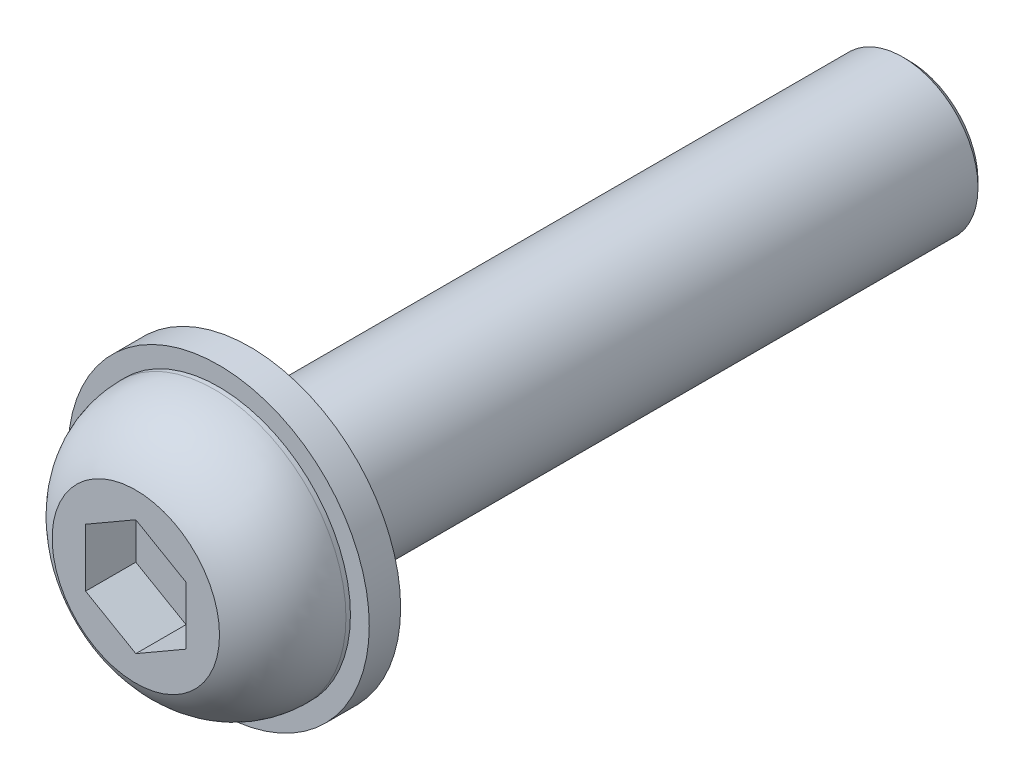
ISO-10303-21;
HEADER;
FILE_DESCRIPTION(('STEP AP214'),'2;1');
FILE_NAME('part.step','',(''),(''),'','','');
FILE_SCHEMA(('AUTOMOTIVE_DESIGN { 1 0 10303 214 1 1 1 1 }'));
ENDSEC;
DATA;
#1=APPLICATION_CONTEXT('core data for automotive mechanical design processes');
#2=APPLICATION_PROTOCOL_DEFINITION('international standard','automotive_design',2000,#1);
#3=PRODUCT_CONTEXT('',#1,'mechanical');
#4=PRODUCT('Part','Part','',(#3));
#5=PRODUCT_RELATED_PRODUCT_CATEGORY('part','',(#4));
#6=PRODUCT_DEFINITION_FORMATION('','',#4);
#7=PRODUCT_DEFINITION_CONTEXT('part definition',#1,'design');
#8=PRODUCT_DEFINITION('design','',#6,#7);
#9=PRODUCT_DEFINITION_SHAPE('','',#8);
#10=(LENGTH_UNIT() NAMED_UNIT(*) SI_UNIT(.MILLI.,.METRE.));
#11=(NAMED_UNIT(*) PLANE_ANGLE_UNIT() SI_UNIT($,.RADIAN.));
#12=(NAMED_UNIT(*) SI_UNIT($,.STERADIAN.) SOLID_ANGLE_UNIT());
#13=UNCERTAINTY_MEASURE_WITH_UNIT(LENGTH_MEASURE(1.E-05),#10,'distance_accuracy_value','');
#14=(GEOMETRIC_REPRESENTATION_CONTEXT(3) GLOBAL_UNCERTAINTY_ASSIGNED_CONTEXT((#13)) GLOBAL_UNIT_ASSIGNED_CONTEXT((#10,
#11,#12)) REPRESENTATION_CONTEXT('',''));
#15=CARTESIAN_POINT('',(0.,0.,0.));
#16=DIRECTION('',(0.,0.,1.));
#17=DIRECTION('',(1.,0.,0.));
#18=AXIS2_PLACEMENT_3D('',#15,#16,#17);
#19=CARTESIAN_POINT('',(0.,4.61880215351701,5.1));
#20=DIRECTION('',(0.,0.,1.));
#21=DIRECTION('',(1.,0.,0.));
#22=AXIS2_PLACEMENT_3D('',#19,#20,#21);
#23=PLANE('',#22);
#24=DIRECTION('',(-0.866025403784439,0.5,0.));
#25=VECTOR('',#24,1.);
#26=CARTESIAN_POINT('',(4.,2.30940107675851,5.1));
#27=LINE('',#26,#25);
#28=CARTESIAN_POINT('',(4.,2.30940107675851,5.1));
#29=VERTEX_POINT('',#28);
#30=CARTESIAN_POINT('',(0.,4.61880215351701,5.1));
#31=VERTEX_POINT('',#30);
#32=EDGE_CURVE('E116',#29,#31,#27,.T.);
#33=ORIENTED_EDGE('',*,*,#32,.T.);
#34=DIRECTION('',(-0.866025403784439,-0.5,0.));
#35=VECTOR('',#34,1.);
#36=CARTESIAN_POINT('',(0.,4.61880215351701,5.1));
#37=LINE('',#36,#35);
#38=CARTESIAN_POINT('',(-4.,2.3094010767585,5.1));
#39=VERTEX_POINT('',#38);
#40=EDGE_CURVE('E98',#31,#39,#37,.T.);
#41=ORIENTED_EDGE('',*,*,#40,.T.);
#42=DIRECTION('',(0.,-1.,0.));
#43=VECTOR('',#42,1.);
#44=CARTESIAN_POINT('',(-4.,2.3094010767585,5.1));
#45=LINE('',#44,#43);
#46=CARTESIAN_POINT('',(-4.,-2.30940107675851,5.1));
#47=VERTEX_POINT('',#46);
#48=EDGE_CURVE('E96',#39,#47,#45,.T.);
#49=ORIENTED_EDGE('',*,*,#48,.T.);
#50=DIRECTION('',(0.866025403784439,-0.5,0.));
#51=VECTOR('',#50,1.);
#52=CARTESIAN_POINT('',(-4.,-2.30940107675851,5.1));
#53=LINE('',#52,#51);
#54=CARTESIAN_POINT('',(0.,-4.61880215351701,5.1));
#55=VERTEX_POINT('',#54);
#56=EDGE_CURVE('E76',#47,#55,#53,.T.);
#57=ORIENTED_EDGE('',*,*,#56,.T.);
#58=DIRECTION('',(0.866025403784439,0.5,0.));
#59=VECTOR('',#58,1.);
#60=CARTESIAN_POINT('',(0.,-4.61880215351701,5.1));
#61=LINE('',#60,#59);
#62=CARTESIAN_POINT('',(4.,-2.30940107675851,5.1));
#63=VERTEX_POINT('',#62);
#64=EDGE_CURVE('E87',#55,#63,#61,.T.);
#65=ORIENTED_EDGE('',*,*,#64,.T.);
#66=DIRECTION('',(0.,1.,0.));
#67=VECTOR('',#66,1.);
#68=CARTESIAN_POINT('',(4.,-2.30940107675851,5.1));
#69=LINE('',#68,#67);
#70=EDGE_CURVE('E91',#63,#29,#69,.T.);
#71=ORIENTED_EDGE('',*,*,#70,.T.);
#72=EDGE_LOOP('',(#33,#41,#49,#57,#65,#71));
#73=FACE_BOUND('',#72,.T.);
#74=ADVANCED_FACE('F14',(#73),#23,.T.);
#75=CARTESIAN_POINT('',(-4.,2.3094010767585,5.1));
#76=DIRECTION('',(-1.,0.,0.));
#77=DIRECTION('',(0.,-1.,0.));
#78=AXIS2_PLACEMENT_3D('',#75,#76,#77);
#79=PLANE('',#78);
#80=DIRECTION('',(0.,-1.,0.));
#81=VECTOR('',#80,1.);
#82=CARTESIAN_POINT('',(-4.,2.3094010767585,9.1));
#83=LINE('',#82,#81);
#84=CARTESIAN_POINT('',(-4.,2.3094010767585,9.1));
#85=VERTEX_POINT('',#84);
#86=CARTESIAN_POINT('',(-4.,-2.30940107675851,9.1));
#87=VERTEX_POINT('',#86);
#88=EDGE_CURVE('E108',#85,#87,#83,.T.);
#89=ORIENTED_EDGE('',*,*,#88,.T.);
#90=DIRECTION('',(0.,0.,1.));
#91=VECTOR('',#90,1.);
#92=CARTESIAN_POINT('',(-4.,-2.30940107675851,5.1));
#93=LINE('',#92,#91);
#94=EDGE_CURVE('E84',#47,#87,#93,.T.);
#95=ORIENTED_EDGE('',*,*,#94,.F.);
#96=ORIENTED_EDGE('',*,*,#48,.F.);
#97=DIRECTION('',(0.,0.,1.));
#98=VECTOR('',#97,1.);
#99=CARTESIAN_POINT('',(-4.,2.3094010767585,5.1));
#100=LINE('',#99,#98);
#101=EDGE_CURVE('E121',#39,#85,#100,.T.);
#102=ORIENTED_EDGE('',*,*,#101,.T.);
#103=EDGE_LOOP('',(#89,#95,#96,#102));
#104=FACE_BOUND('',#103,.T.);
#105=ADVANCED_FACE('F171',(#104),#79,.F.);
#106=CARTESIAN_POINT('',(-4.,-2.30940107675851,5.1));
#107=DIRECTION('',(-0.5,-0.866025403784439,0.));
#108=DIRECTION('',(0.866025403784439,-0.5,0.));
#109=AXIS2_PLACEMENT_3D('',#106,#107,#108);
#110=PLANE('',#109);
#111=DIRECTION('',(0.866025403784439,-0.5,0.));
#112=VECTOR('',#111,1.);
#113=CARTESIAN_POINT('',(-4.,-2.30940107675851,9.1));
#114=LINE('',#113,#112);
#115=CARTESIAN_POINT('',(0.,-4.61880215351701,9.1));
#116=VERTEX_POINT('',#115);
#117=EDGE_CURVE('E79',#87,#116,#114,.T.);
#118=ORIENTED_EDGE('',*,*,#117,.T.);
#119=DIRECTION('',(0.,0.,1.));
#120=VECTOR('',#119,1.);
#121=CARTESIAN_POINT('',(0.,-4.61880215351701,5.1));
#122=LINE('',#121,#120);
#123=EDGE_CURVE('E72',#55,#116,#122,.T.);
#124=ORIENTED_EDGE('',*,*,#123,.F.);
#125=ORIENTED_EDGE('',*,*,#56,.F.);
#126=ORIENTED_EDGE('',*,*,#94,.T.);
#127=EDGE_LOOP('',(#118,#124,#125,#126));
#128=FACE_BOUND('',#127,.T.);
#129=ADVANCED_FACE('F74',(#128),#110,.F.);
#130=CARTESIAN_POINT('',(0.,-4.61880215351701,5.1));
#131=DIRECTION('',(0.5,-0.866025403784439,0.));
#132=DIRECTION('',(0.866025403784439,0.5,0.));
#133=AXIS2_PLACEMENT_3D('',#130,#131,#132);
#134=PLANE('',#133);
#135=DIRECTION('',(0.866025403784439,0.5,0.));
#136=VECTOR('',#135,1.);
#137=CARTESIAN_POINT('',(0.,-4.61880215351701,9.1));
#138=LINE('',#137,#136);
#139=CARTESIAN_POINT('',(4.,-2.30940107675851,9.1));
#140=VERTEX_POINT('',#139);
#141=EDGE_CURVE('E112',#116,#140,#138,.T.);
#142=ORIENTED_EDGE('',*,*,#141,.T.);
#143=DIRECTION('',(0.,0.,1.));
#144=VECTOR('',#143,1.);
#145=CARTESIAN_POINT('',(4.,-2.30940107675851,5.1));
#146=LINE('',#145,#144);
#147=EDGE_CURVE('E83',#63,#140,#146,.T.);
#148=ORIENTED_EDGE('',*,*,#147,.F.);
#149=ORIENTED_EDGE('',*,*,#64,.F.);
#150=ORIENTED_EDGE('',*,*,#123,.T.);
#151=EDGE_LOOP('',(#142,#148,#149,#150));
#152=FACE_BOUND('',#151,.T.);
#153=ADVANCED_FACE('F88',(#152),#134,.F.);
#154=CARTESIAN_POINT('',(4.,-2.30940107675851,5.1));
#155=DIRECTION('',(1.,0.,0.));
#156=DIRECTION('',(0.,1.,0.));
#157=AXIS2_PLACEMENT_3D('',#154,#155,#156);
#158=PLANE('',#157);
#159=DIRECTION('',(0.,1.,0.));
#160=VECTOR('',#159,1.);
#161=CARTESIAN_POINT('',(4.,-2.30940107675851,9.1));
#162=LINE('',#161,#160);
#163=CARTESIAN_POINT('',(4.,2.30940107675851,9.1));
#164=VERTEX_POINT('',#163);
#165=EDGE_CURVE('E114',#140,#164,#162,.T.);
#166=ORIENTED_EDGE('',*,*,#165,.T.);
#167=DIRECTION('',(0.,0.,1.));
#168=VECTOR('',#167,1.);
#169=CARTESIAN_POINT('',(4.,2.30940107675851,5.1));
#170=LINE('',#169,#168);
#171=EDGE_CURVE('E39',#29,#164,#170,.T.);
#172=ORIENTED_EDGE('',*,*,#171,.F.);
#173=ORIENTED_EDGE('',*,*,#70,.F.);
#174=ORIENTED_EDGE('',*,*,#147,.T.);
#175=EDGE_LOOP('',(#166,#172,#173,#174));
#176=FACE_BOUND('',#175,.T.);
#177=ADVANCED_FACE('F180',(#176),#158,.F.);
#178=CARTESIAN_POINT('',(4.,2.30940107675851,5.1));
#179=DIRECTION('',(0.5,0.866025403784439,0.));
#180=DIRECTION('',(-0.866025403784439,0.5,0.));
#181=AXIS2_PLACEMENT_3D('',#178,#179,#180);
#182=PLANE('',#181);
#183=DIRECTION('',(-0.866025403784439,0.5,0.));
#184=VECTOR('',#183,1.);
#185=CARTESIAN_POINT('',(4.,2.30940107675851,9.1));
#186=LINE('',#185,#184);
#187=CARTESIAN_POINT('',(0.,4.61880215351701,9.1));
#188=VERTEX_POINT('',#187);
#189=EDGE_CURVE('E31',#164,#188,#186,.T.);
#190=ORIENTED_EDGE('',*,*,#189,.T.);
#191=DIRECTION('',(0.,0.,1.));
#192=VECTOR('',#191,1.);
#193=CARTESIAN_POINT('',(0.,4.61880215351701,5.1));
#194=LINE('',#193,#192);
#195=EDGE_CURVE('E61',#31,#188,#194,.T.);
#196=ORIENTED_EDGE('',*,*,#195,.F.);
#197=ORIENTED_EDGE('',*,*,#32,.F.);
#198=ORIENTED_EDGE('',*,*,#171,.T.);
#199=EDGE_LOOP('',(#190,#196,#197,#198));
#200=FACE_BOUND('',#199,.T.);
#201=ADVANCED_FACE('F183',(#200),#182,.F.);
#202=CARTESIAN_POINT('',(0.,4.61880215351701,5.1));
#203=DIRECTION('',(-0.5,0.866025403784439,0.));
#204=DIRECTION('',(-0.866025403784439,-0.5,0.));
#205=AXIS2_PLACEMENT_3D('',#202,#203,#204);
#206=PLANE('',#205);
#207=DIRECTION('',(-0.866025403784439,-0.5,0.));
#208=VECTOR('',#207,1.);
#209=CARTESIAN_POINT('',(0.,4.61880215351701,9.1));
#210=LINE('',#209,#208);
#211=EDGE_CURVE('E104',#188,#85,#210,.T.);
#212=ORIENTED_EDGE('',*,*,#211,.T.);
#213=ORIENTED_EDGE('',*,*,#101,.F.);
#214=ORIENTED_EDGE('',*,*,#40,.F.);
#215=ORIENTED_EDGE('',*,*,#195,.T.);
#216=EDGE_LOOP('',(#212,#213,#214,#215));
#217=FACE_BOUND('',#216,.T.);
#218=ADVANCED_FACE('F188',(#217),#206,.F.);
#219=CARTESIAN_POINT('',(0.,0.,9.1));
#220=DIRECTION('',(0.,0.,-1.));
#221=DIRECTION('',(-1.,0.,0.));
#222=AXIS2_PLACEMENT_3D('',#219,#220,#221);
#223=PLANE('',#222);
#224=ORIENTED_EDGE('',*,*,#211,.F.);
#225=ORIENTED_EDGE('',*,*,#189,.F.);
#226=ORIENTED_EDGE('',*,*,#165,.F.);
#227=ORIENTED_EDGE('',*,*,#141,.F.);
#228=ORIENTED_EDGE('',*,*,#117,.F.);
#229=ORIENTED_EDGE('',*,*,#88,.F.);
#230=EDGE_LOOP('',(#224,#225,#226,#227,#228,#229));
#231=FACE_BOUND('',#230,.T.);
#232=CARTESIAN_POINT('',(0.,0.,9.1));
#233=DIRECTION('',(0.,0.,1.));
#234=DIRECTION('',(1.,0.,0.));
#235=AXIS2_PLACEMENT_3D('',#232,#233,#234);
#236=CIRCLE('',#235,6.66774468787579);
#237=CARTESIAN_POINT('',(6.66774468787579,0.,9.1));
#238=VERTEX_POINT('',#237);
#239=EDGE_CURVE('E126',#238,#238,#236,.T.);
#240=ORIENTED_EDGE('',*,*,#239,.T.);
#241=EDGE_LOOP('',(#240));
#242=FACE_BOUND('',#241,.T.);
#243=ADVANCED_FACE('F191',(#231,#242),#223,.F.);
#244=CARTESIAN_POINT('',(0.,0.,2.8577733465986));
#245=DIRECTION('',(0.,0.,1.));
#246=DIRECTION('',(1.,0.,0.));
#247=AXIS2_PLACEMENT_3D('',#244,#245,#246);
#248=DEGENERATE_TOROIDAL_SURFACE('',#247,3.5,7.,.T.);
#249=ORIENTED_EDGE('',*,*,#239,.F.);
#250=EDGE_LOOP('',(#249));
#251=FACE_BOUND('',#250,.T.);
#252=CARTESIAN_POINT('',(0.,0.,2.8577733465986));
#253=DIRECTION('',(0.,0.,1.));
#254=DIRECTION('',(1.,0.,0.));
#255=AXIS2_PLACEMENT_3D('',#252,#253,#254);
#256=CIRCLE('',#255,10.5);
#257=CARTESIAN_POINT('',(10.5,0.,2.8577733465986));
#258=VERTEX_POINT('',#257);
#259=EDGE_CURVE('E129',#258,#258,#256,.T.);
#260=ORIENTED_EDGE('',*,*,#259,.T.);
#261=EDGE_LOOP('',(#260));
#262=FACE_BOUND('',#261,.T.);
#263=ADVANCED_FACE('F204',(#251,#262),#248,.T.);
#264=CARTESIAN_POINT('',(0.,0.,9.1));
#265=DIRECTION('',(0.,0.,1.));
#266=DIRECTION('',(1.,0.,0.));
#267=AXIS2_PLACEMENT_3D('',#264,#265,#266);
#268=CYLINDRICAL_SURFACE('',#267,10.5);
#269=ORIENTED_EDGE('',*,*,#259,.F.);
#270=EDGE_LOOP('',(#269));
#271=FACE_BOUND('',#270,.T.);
#272=CARTESIAN_POINT('',(0.,0.,2.5));
#273=DIRECTION('',(0.,0.,1.));
#274=DIRECTION('',(1.,0.,0.));
#275=AXIS2_PLACEMENT_3D('',#272,#273,#274);
#276=CIRCLE('',#275,10.5);
#277=CARTESIAN_POINT('',(10.5,0.,2.5));
#278=VERTEX_POINT('',#277);
#279=EDGE_CURVE('E132',#278,#278,#276,.T.);
#280=ORIENTED_EDGE('',*,*,#279,.T.);
#281=EDGE_LOOP('',(#280));
#282=FACE_BOUND('',#281,.T.);
#283=ADVANCED_FACE('F208',(#271,#282),#268,.T.);
#284=CARTESIAN_POINT('',(-6.,0.,2.5));
#285=DIRECTION('',(0.,0.,1.));
#286=DIRECTION('',(1.,0.,0.));
#287=AXIS2_PLACEMENT_3D('',#284,#285,#286);
#288=PLANE('',#287);
#289=CARTESIAN_POINT('',(0.,0.,2.5));
#290=DIRECTION('',(0.,0.,1.));
#291=DIRECTION('',(1.,0.,0.));
#292=AXIS2_PLACEMENT_3D('',#289,#290,#291);
#293=CIRCLE('',#292,6.);
#294=CARTESIAN_POINT('',(6.,0.,2.5));
#295=VERTEX_POINT('',#294);
#296=EDGE_CURVE('E118',#295,#295,#293,.T.);
#297=ORIENTED_EDGE('',*,*,#296,.T.);
#298=EDGE_LOOP('',(#297));
#299=FACE_BOUND('',#298,.T.);
#300=CARTESIAN_POINT('',(0.,0.,2.5));
#301=DIRECTION('',(0.,0.,1.));
#302=DIRECTION('',(0.,-1.,0.));
#303=AXIS2_PLACEMENT_3D('',#300,#301,#302);
#304=CIRCLE('',#303,6.5);
#305=CARTESIAN_POINT('',(0.,-6.5,2.5));
#306=VERTEX_POINT('',#305);
#307=EDGE_CURVE('E9',#306,#306,#304,.T.);
#308=ORIENTED_EDGE('',*,*,#307,.F.);
#309=EDGE_LOOP('',(#308));
#310=FACE_BOUND('',#309,.T.);
#311=ADVANCED_FACE('F162',(#299,#310),#288,.F.);
#312=CARTESIAN_POINT('',(-6.,0.,-52.5));
#313=DIRECTION('',(0.,0.,1.));
#314=DIRECTION('',(1.,0.,0.));
#315=AXIS2_PLACEMENT_3D('',#312,#313,#314);
#316=PLANE('',#315);
#317=CARTESIAN_POINT('',(0.,0.,-52.5));
#318=DIRECTION('',(0.,0.,1.));
#319=DIRECTION('',(1.,0.,0.));
#320=AXIS2_PLACEMENT_3D('',#317,#318,#319);
#321=CIRCLE('',#320,5.5);
#322=CARTESIAN_POINT('',(5.5,0.,-52.5));
#323=VERTEX_POINT('',#322);
#324=EDGE_CURVE('E23',#323,#323,#321,.F.);
#325=ORIENTED_EDGE('',*,*,#324,.T.);
#326=EDGE_LOOP('',(#325));
#327=FACE_BOUND('',#326,.T.);
#328=ADVANCED_FACE('F197',(#327),#316,.F.);
#329=CARTESIAN_POINT('',(0.,0.,9.1));
#330=DIRECTION('',(0.,0.,1.));
#331=DIRECTION('',(1.,0.,0.));
#332=AXIS2_PLACEMENT_3D('',#329,#330,#331);
#333=CYLINDRICAL_SURFACE('',#332,6.);
#334=CARTESIAN_POINT('',(0.,0.,-52.));
#335=DIRECTION('',(0.,0.,1.));
#336=DIRECTION('',(1.,0.,0.));
#337=AXIS2_PLACEMENT_3D('',#334,#335,#336);
#338=CIRCLE('',#337,6.);
#339=CARTESIAN_POINT('',(6.,0.,-52.));
#340=VERTEX_POINT('',#339);
#341=EDGE_CURVE('E135',#340,#340,#338,.T.);
#342=ORIENTED_EDGE('',*,*,#341,.T.);
#343=EDGE_LOOP('',(#342));
#344=FACE_BOUND('',#343,.T.);
#345=ORIENTED_EDGE('',*,*,#296,.F.);
#346=EDGE_LOOP('',(#345));
#347=FACE_BOUND('',#346,.T.);
#348=ADVANCED_FACE('F163',(#344,#347),#333,.T.);
#349=CARTESIAN_POINT('',(0.,0.,-52.));
#350=DIRECTION('',(0.,0.,1.));
#351=DIRECTION('',(1.,0.,0.));
#352=AXIS2_PLACEMENT_3D('',#349,#350,#351);
#353=CONICAL_SURFACE('',#352,6.,0.785398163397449);
#354=ORIENTED_EDGE('',*,*,#324,.F.);
#355=EDGE_LOOP('',(#354));
#356=FACE_BOUND('',#355,.T.);
#357=ORIENTED_EDGE('',*,*,#341,.F.);
#358=EDGE_LOOP('',(#357));
#359=FACE_BOUND('',#358,.T.);
#360=ADVANCED_FACE('F152',(#356,#359),#353,.T.);
#361=CARTESIAN_POINT('',(0.,0.,0.));
#362=DIRECTION('',(0.,0.,1.));
#363=DIRECTION('',(1.,0.,0.));
#364=AXIS2_PLACEMENT_3D('',#361,#362,#363);
#365=PLANE('',#364);
#366=CARTESIAN_POINT('',(0.,0.,0.));
#367=DIRECTION('',(0.,0.,1.));
#368=DIRECTION('',(1.,0.,0.));
#369=AXIS2_PLACEMENT_3D('',#366,#367,#368);
#370=CIRCLE('',#369,6.5);
#371=CARTESIAN_POINT('',(6.5,0.,0.));
#372=VERTEX_POINT('',#371);
#373=EDGE_CURVE('E140',#372,#372,#370,.T.);
#374=ORIENTED_EDGE('',*,*,#373,.T.);
#375=EDGE_LOOP('',(#374));
#376=FACE_BOUND('',#375,.T.);
#377=CARTESIAN_POINT('',(0.,0.,0.));
#378=DIRECTION('',(0.,0.,1.));
#379=DIRECTION('',(1.,0.,0.));
#380=AXIS2_PLACEMENT_3D('',#377,#378,#379);
#381=CIRCLE('',#380,12.);
#382=CARTESIAN_POINT('',(12.,0.,0.));
#383=VERTEX_POINT('',#382);
#384=EDGE_CURVE('E18',#383,#383,#381,.T.);
#385=ORIENTED_EDGE('',*,*,#384,.F.);
#386=EDGE_LOOP('',(#385));
#387=FACE_BOUND('',#386,.T.);
#388=ADVANCED_FACE('F149',(#376,#387),#365,.F.);
#389=CARTESIAN_POINT('',(0.,0.,0.));
#390=DIRECTION('',(0.,0.,1.));
#391=DIRECTION('',(1.,0.,0.));
#392=AXIS2_PLACEMENT_3D('',#389,#390,#391);
#393=CYLINDRICAL_SURFACE('',#392,6.5);
#394=ORIENTED_EDGE('',*,*,#373,.F.);
#395=EDGE_LOOP('',(#394));
#396=FACE_BOUND('',#395,.T.);
#397=ORIENTED_EDGE('',*,*,#307,.T.);
#398=EDGE_LOOP('',(#397));
#399=FACE_BOUND('',#398,.T.);
#400=ADVANCED_FACE('F151',(#396,#399),#393,.F.);
#401=CARTESIAN_POINT('',(0.,0.,2.5));
#402=DIRECTION('',(0.,0.,-1.));
#403=DIRECTION('',(-1.,0.,0.));
#404=AXIS2_PLACEMENT_3D('',#401,#402,#403);
#405=CYLINDRICAL_SURFACE('',#404,12.);
#406=CARTESIAN_POINT('',(0.,0.,2.5));
#407=DIRECTION('',(0.,0.,1.));
#408=DIRECTION('',(1.,0.,0.));
#409=AXIS2_PLACEMENT_3D('',#406,#407,#408);
#410=CIRCLE('',#409,12.);
#411=CARTESIAN_POINT('',(12.,0.,2.5));
#412=VERTEX_POINT('',#411);
#413=EDGE_CURVE('E105',#412,#412,#410,.T.);
#414=ORIENTED_EDGE('',*,*,#413,.F.);
#415=EDGE_LOOP('',(#414));
#416=FACE_BOUND('',#415,.T.);
#417=ORIENTED_EDGE('',*,*,#384,.T.);
#418=EDGE_LOOP('',(#417));
#419=FACE_BOUND('',#418,.T.);
#420=ADVANCED_FACE('F16',(#416,#419),#405,.T.);
#421=CARTESIAN_POINT('',(0.,0.,2.5));
#422=DIRECTION('',(0.,0.,1.));
#423=DIRECTION('',(1.,0.,0.));
#424=AXIS2_PLACEMENT_3D('',#421,#422,#423);
#425=PLANE('',#424);
#426=ORIENTED_EDGE('',*,*,#413,.T.);
#427=EDGE_LOOP('',(#426));
#428=FACE_BOUND('',#427,.T.);
#429=ORIENTED_EDGE('',*,*,#279,.F.);
#430=EDGE_LOOP('',(#429));
#431=FACE_BOUND('',#430,.T.);
#432=ADVANCED_FACE('F168',(#428,#431),#425,.T.);
#433=CLOSED_SHELL('',(#74,#105,#129,#153,#177,#201,#218,#243,#263,#283,#311,#328,#348,#360,#388,
#400,#420,#432));
#434=MANIFOLD_SOLID_BREP('B1',#433);
#435=ADVANCED_BREP_SHAPE_REPRESENTATION('',(#18,#434),#14);
#436=SHAPE_DEFINITION_REPRESENTATION(#9,#435);
ENDSEC;
END-ISO-10303-21;
